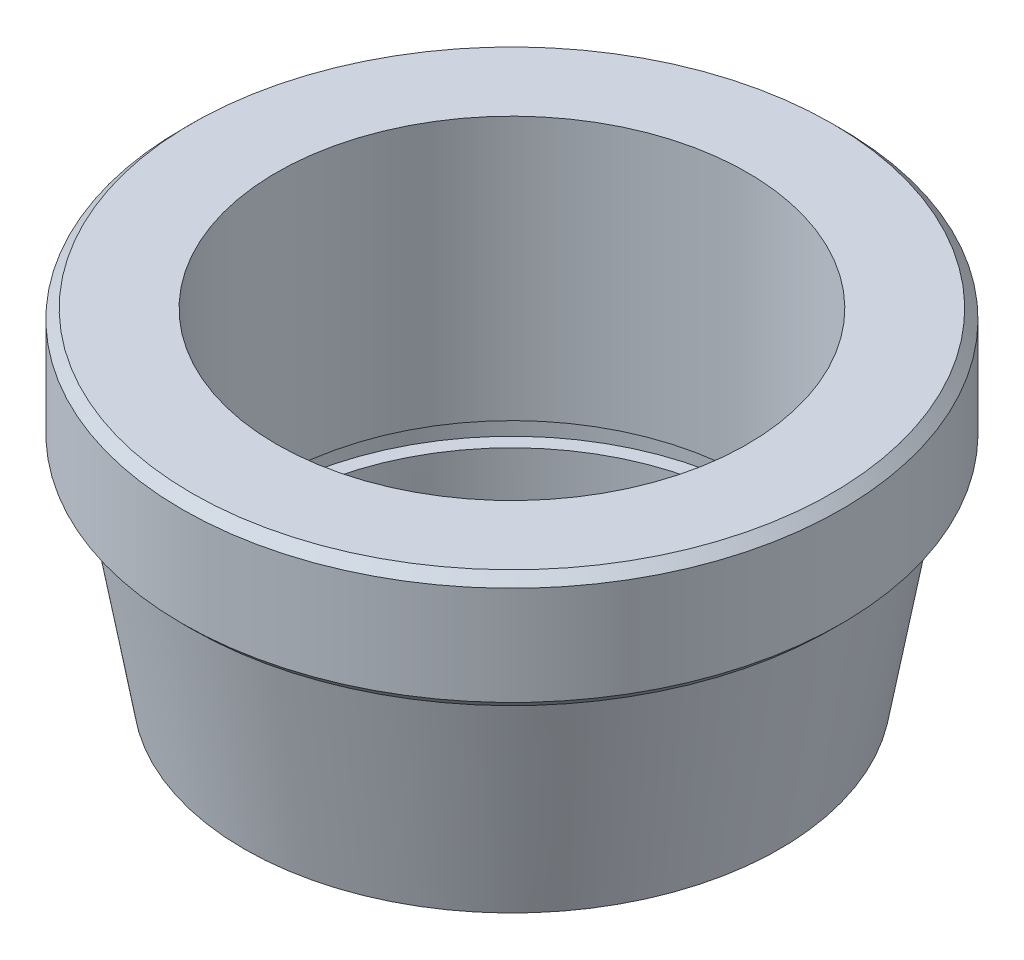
from build123d import *

# Parameters (mm, degrees)
SKICA1_R                 = 6.5
P_IDAT_VYSUNUT_M1_DEPTH  = 4.6
P_IDAT_VYSUNUT_M1_DRAFT  = -10
SKICA2_R                 = 7
P_IDAT_VYSUNUT_M2_DEPTH  = 2.5
ZKOSEN_1_SIZE            = 0.2
SKICA3_R                 = 5
ODEBRAT_VYSUNUT_M1_DEPTH = 2.5
ODEBRAT_START            = -4.6
SKICA4_R                 = 5
ODEBRAT_VYSUNUT_M2_DEPTH = 4.6
SKICA5_W                 = 0.3
SKICA5_H                 = 0.5


with BuildPart() as part:
    # Skica1 → P_idat vysunut_m1 (with draft: the straight prism first)
    with BuildSketch(Plane(origin=(0, 0, 0), x_dir=(1, 0, 0), z_dir=(0, 1, 0))):
        Circle(SKICA1_R)
    extrude(amount=-P_IDAT_VYSUNUT_M1_DEPTH)
    # P_idat vysunut_m1: the draft: its side faces are tilted about the plane it starts from
    p_idat_vysunut_m1_sides = [part.faces().sort_by_distance(p)[0] for p in [
        (-6.5, -2.3, 0),
    ]]
    draft(p_idat_vysunut_m1_sides, Plane(origin=(0, 0, 0), x_dir=(1, 0, 0), z_dir=(0, 1, 0)), P_IDAT_VYSUNUT_M1_DRAFT)

    # Skica2 → P_idat vysunut_m2 (add)
    with BuildSketch(Plane(origin=(0, 0, 0), x_dir=(-1, 0, 0), z_dir=(0, 1, 0))):
        with Locations(Location((0, 0, 0), (0, 0, 90))):
            Circle(SKICA2_R)
    extrude(amount=P_IDAT_VYSUNUT_M2_DEPTH)

    # Zkosen_1
    zkosen_1_edges = [part.edges().sort_by_distance(p)[0] for p in [
        (0, 0, -7),
        (0, 2.5, -7),
    ]]
    chamfer(zkosen_1_edges, length=ZKOSEN_1_SIZE)

    # Skica3 → Odebrat vysunut_m1 (cut)
    with BuildSketch(Plane(origin=(0, 2.5, 0), x_dir=(1, 0, 0), z_dir=(0, 1, 0))):
        with Locations(Location((0, 0, 0), (0, 0, 270))):
            Circle(SKICA3_R)
    extrude(amount=-ODEBRAT_VYSUNUT_M1_DEPTH, mode=Mode.SUBTRACT)

    # Skica4 → Odebrat vysunut_m2 (cut)
    with BuildSketch(Plane.XZ.offset(4.6).offset(ODEBRAT_START)):
        with Locations(Location((0, 0, 0), (0, 0, 90))):
            Circle(SKICA4_R)
    extrude(amount=ODEBRAT_VYSUNUT_M2_DEPTH, mode=Mode.SUBTRACT)

    # Skica5 → Odebrat rotac_1 (revolve, cut)
    with BuildSketch(Plane.XY, mode=Mode.PRIVATE) as odebrat_rotac_1_sk:
        with Locations((-5.15, -3.35)):
            Rectangle(SKICA5_W, SKICA5_H)
    revolve(odebrat_rotac_1_sk.sketch.rotate(Axis((0, 2.5, 0), (0, -1, 0)), 270), axis=Axis((0, 2.5, 0), (0, -1, 0)), mode=Mode.SUBTRACT)


solid = part.part
